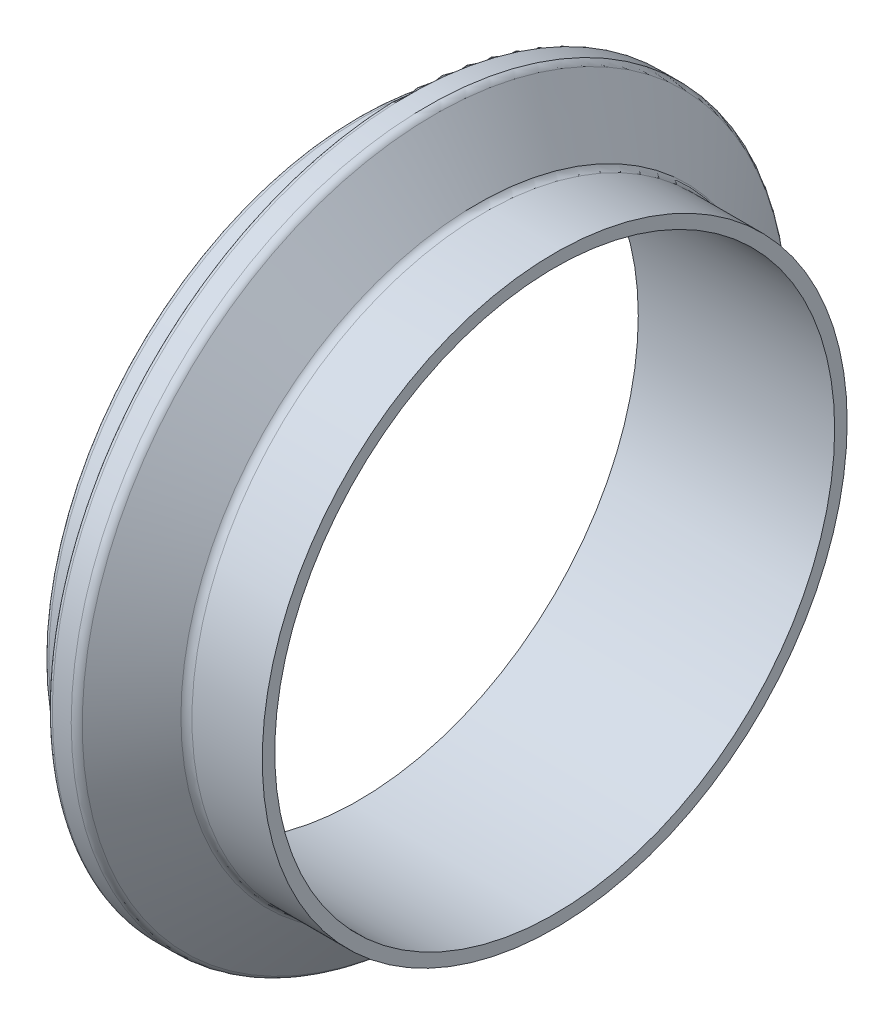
from build123d import *


with BuildPart() as part:
    # Sketch1 → Revolve1 (revolve)
    with BuildSketch(Plane.XY, mode=Mode.PRIVATE) as revolve1_sk:
        with BuildLine():
            Line((0, 48.6283), (-34.1122, 48.6283))
            Line((-34.1122, 48.6283), (-34.1122, 53.7718))
            ThreePointArc((-34.1122, 53.7718), (-33.874136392, 54.346536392), (-33.2994, 54.5846))
            Line((-33.2994, 54.5846), (-27.051, 54.5846))
            ThreePointArc((-27.051, 54.5846), (-26.476263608, 54.822663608), (-26.2382, 55.3974))
            Line((-26.2382, 55.3974), (-26.2382, 61.0362))
            ThreePointArc((-26.2382, 61.0362), (-26.000136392, 61.610936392), (-25.4254, 61.849))
            Line((-25.4254, 61.849), (-22.133830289, 61.849))
            ThreePointArc((-22.133830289, 61.849), (-21.419824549, 61.680873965), (-20.855853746, 61.2118244))
            Line((-20.855853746, 61.2118244), (-13.490127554, 51.4371756))
            ThreePointArc((-13.490127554, 51.4371756), (-12.926156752, 50.968126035), (-12.212151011, 50.8))
            Line((-12.212151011, 50.8), (0, 50.8))
            Line((0, 50.8), (0, 48.6283))
        make_face()
    revolve(revolve1_sk.sketch.rotate(Axis((0, 0, 0), (-1, 0, 0)), 90), axis=Axis((0, 0, 0), (-1, 0, 0)))


solid = part.part
